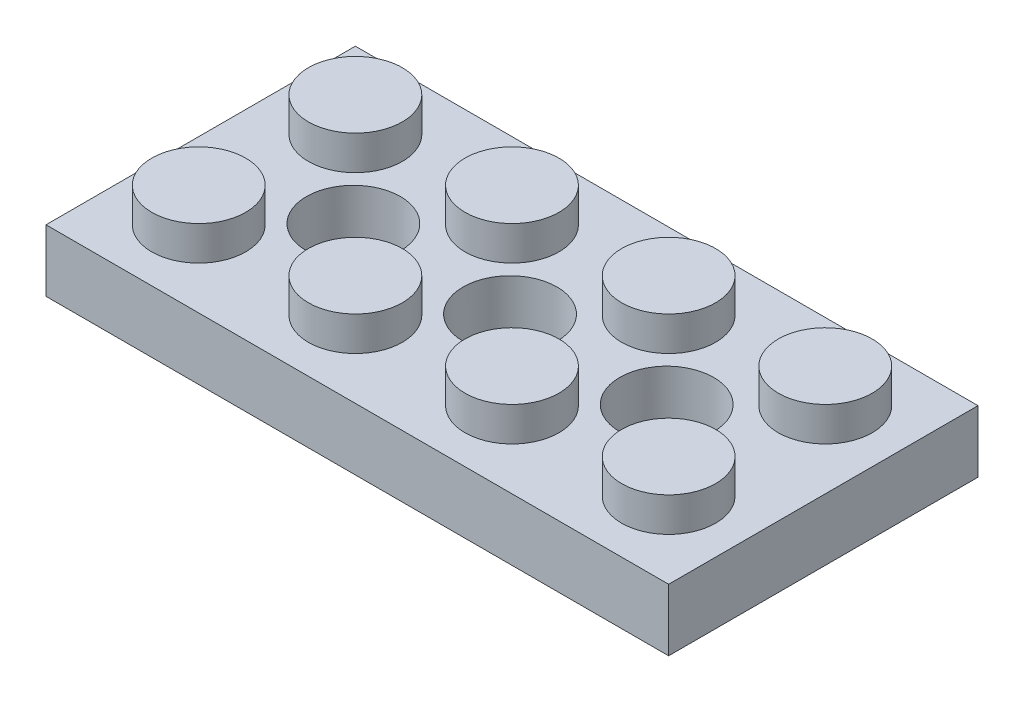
from build123d import *

# Parameters (mm, degrees)
SKETCH1_W       = 31.8
SKETCH1_H       = 15.8
EXTRUDE1_DEPTH  = 3.166
SKETCH2_R       = 2.4
EXTRUDE2_DEPTH  = 1.75
SKETCH5_W       = 30.8
SKETCH5_H       = 14.8
EXTRUDE4_DEPTH  = 2.5
SKETCH6_R       = 3.4
EXTRUDE5_DEPTH  = 2.5
SKETCH7_R       = 2.4
EXTRUDE6_DEPTH  = 19.422460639
LPATTERN1_COUNT = 4
LPATTERN1_PITCH = 8
LPATTERN3_COUNT = 3
LPATTERN3_PITCH = 8


with BuildPart() as part:
    # Sketch1 → Extrude1 (new body)
    with BuildSketch(Plane(origin=(0, 0, 0), x_dir=(1, 0, 0), z_dir=(0, 1, 0))):
        Rectangle(SKETCH1_W, SKETCH1_H)
    extrude(amount=EXTRUDE1_DEPTH)

    # Sketch2 → Extrude2 (add)
    with BuildSketch(Plane(origin=(0, 3.166, 0), x_dir=(1, 0, 0), z_dir=(0, 1, 0))):
        with Locations(Location((12, 4, 0), (0, 0, 270))):
            Circle(SKETCH2_R)
        with Locations(Location((12, -4, 0), (0, 0, 270))):
            Circle(SKETCH2_R)
    extrude2 = extrude(amount=EXTRUDE2_DEPTH)

    # Sketch5 → Extrude4 (cut)
    with BuildSketch(Plane.XZ):
        Rectangle(SKETCH5_W, SKETCH5_H)
    extrude(amount=-EXTRUDE4_DEPTH, mode=Mode.SUBTRACT)

    # Sketch6 → Extrude5 (add)
    with BuildSketch(Plane.XZ.offset(-2.5)):
        with Locations(Location((7.9, 0, 0), (0, 0, 270))):
            Circle(SKETCH6_R)
    extrude5 = extrude(amount=EXTRUDE5_DEPTH)

    # Sketch7 → Extrude6 (cut, through all)
    with BuildSketch(Plane.XZ):
        with Locations(Location((7.9, 0, 0), (0, 0, 270))):
            Circle(SKETCH7_R)
    extrude6 = extrude(amount=-EXTRUDE6_DEPTH, mode=Mode.SUBTRACT)

    # LPattern1: Extrude2 ×4
    with Locations(*[(-i * LPATTERN1_PITCH, 0, 0) for i in range(1, LPATTERN1_COUNT)]):
        add(extrude2)

    # LPattern3: Extrude5, Extrude6 ×3
    with Locations(*[(-i * LPATTERN3_PITCH, 0, 0) for i in range(1, LPATTERN3_COUNT)]):
        add(extrude5)
        add(extrude6, mode=Mode.SUBTRACT)


solid = part.part
